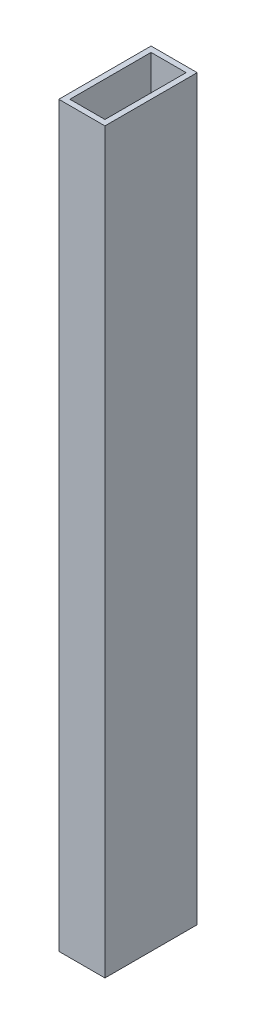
from build123d import *

# Parameters (mm, degrees)
SKETCH1_W          = 50
SKETCH1_H          = 400
EXTRUDE1_DEPTH     = 25
CUT_EXTRUDE1_REACH = 405.887
SKETCH2_W          = 19
SKETCH2_H          = 44


with BuildPart() as part:
    # Sketch1 → Extrude1 (new body)
    with BuildSketch(Plane(origin=(0, 0, 0), x_dir=(0, 0, -1), z_dir=(1, 0, 0))):
        with Locations((25, 200)):
            Rectangle(SKETCH1_W, SKETCH1_H)
    extrude(amount=EXTRUDE1_DEPTH)

    # Sketch2 → Cut-Extrude1 (cut, up to next)
    with BuildSketch(Plane.XZ, mode=Mode.PRIVATE) as cut_extrude1_sk1:
        with Locations((12.5, -25)):
            Rectangle(SKETCH2_W, SKETCH2_H)
    cut_extrude1_tool1 = extrude(cut_extrude1_sk1.sketch, amount=-CUT_EXTRUDE1_REACH, mode=Mode.PRIVATE) & part.part
    add(cut_extrude1_tool1.solids().sort_by_distance((12.5, 0, -25))[0], mode=Mode.SUBTRACT)


solid = part.part
